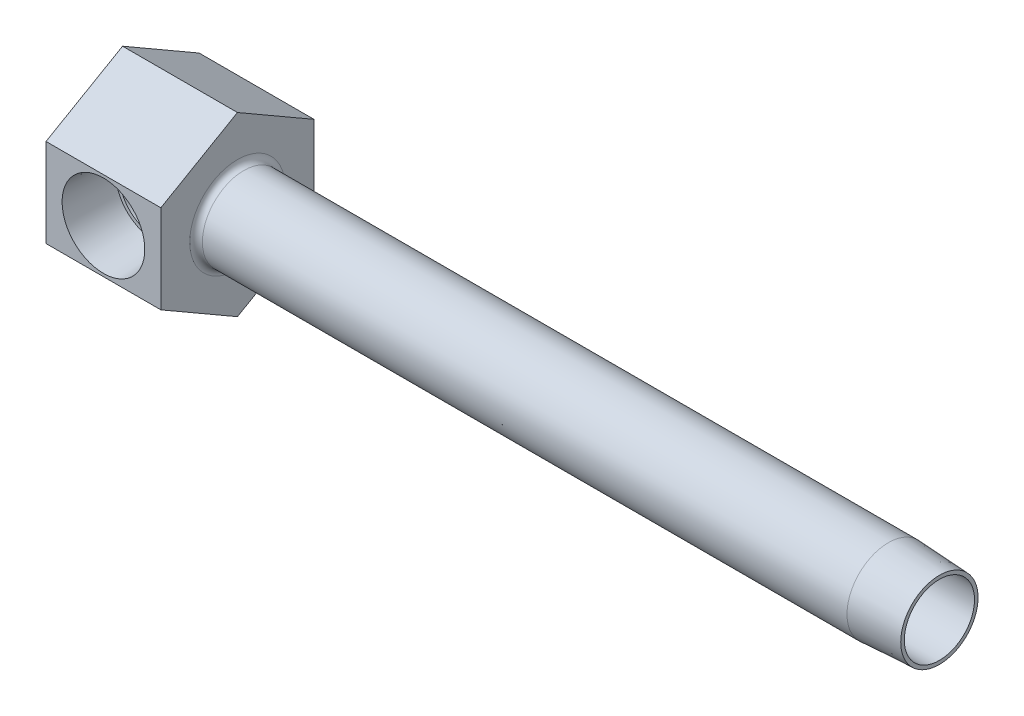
ISO-10303-21;
HEADER;
FILE_DESCRIPTION(('STEP AP214'),'2;1');
FILE_NAME('part.step','',(''),(''),'','','');
FILE_SCHEMA(('AUTOMOTIVE_DESIGN { 1 0 10303 214 1 1 1 1 }'));
ENDSEC;
DATA;
#1=APPLICATION_CONTEXT('core data for automotive mechanical design processes');
#2=APPLICATION_PROTOCOL_DEFINITION('international standard','automotive_design',2000,#1);
#3=PRODUCT_CONTEXT('',#1,'mechanical');
#4=PRODUCT('Part','Part','',(#3));
#5=PRODUCT_RELATED_PRODUCT_CATEGORY('part','',(#4));
#6=PRODUCT_DEFINITION_FORMATION('','',#4);
#7=PRODUCT_DEFINITION_CONTEXT('part definition',#1,'design');
#8=PRODUCT_DEFINITION('design','',#6,#7);
#9=PRODUCT_DEFINITION_SHAPE('','',#8);
#10=(LENGTH_UNIT() NAMED_UNIT(*) SI_UNIT(.MILLI.,.METRE.));
#11=(NAMED_UNIT(*) PLANE_ANGLE_UNIT() SI_UNIT($,.RADIAN.));
#12=(NAMED_UNIT(*) SI_UNIT($,.STERADIAN.) SOLID_ANGLE_UNIT());
#13=UNCERTAINTY_MEASURE_WITH_UNIT(LENGTH_MEASURE(1.E-05),#10,'distance_accuracy_value','');
#14=(GEOMETRIC_REPRESENTATION_CONTEXT(3) GLOBAL_UNCERTAINTY_ASSIGNED_CONTEXT((#13)) GLOBAL_UNIT_ASSIGNED_CONTEXT((#10,
#11,#12)) REPRESENTATION_CONTEXT('',''));
#15=CARTESIAN_POINT('',(0.,0.,0.));
#16=DIRECTION('',(0.,0.,1.));
#17=DIRECTION('',(1.,0.,0.));
#18=AXIS2_PLACEMENT_3D('',#15,#16,#17);
#19=CARTESIAN_POINT('',(7.14375,0.,19.05));
#20=DIRECTION('',(0.,0.,1.));
#21=DIRECTION('',(1.,0.,0.));
#22=AXIS2_PLACEMENT_3D('',#19,#20,#21);
#23=CONICAL_SURFACE('',#22,5.1435,0.0523598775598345);
#24=CARTESIAN_POINT('',(7.14375,0.,19.05));
#25=DIRECTION('',(0.,0.,-1.));
#26=DIRECTION('',(-1.,0.,0.));
#27=AXIS2_PLACEMENT_3D('',#24,#25,#26);
#28=CIRCLE('',#27,5.1435);
#29=CARTESIAN_POINT('',(2.00025,0.,19.05));
#30=VERTEX_POINT('',#29);
#31=EDGE_CURVE('E191',#30,#30,#28,.T.);
#32=ORIENTED_EDGE('',*,*,#31,.F.);
#33=EDGE_LOOP('',(#32));
#34=FACE_BOUND('',#33,.T.);
#35=CARTESIAN_POINT('',(7.14375,0.,12.7000000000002));
#36=DIRECTION('',(0.,0.,-1.));
#37=DIRECTION('',(-1.,0.,0.));
#38=AXIS2_PLACEMENT_3D('',#35,#36,#37);
#39=CIRCLE('',#38,4.81071060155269);
#40=CARTESIAN_POINT('',(10.9073758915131,-2.99634054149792,12.7000000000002));
#41=VERTEX_POINT('',#40);
#42=CARTESIAN_POINT('',(10.9073758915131,2.99634054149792,12.7000000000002));
#43=VERTEX_POINT('',#42);
#44=EDGE_CURVE('E188',#41,#43,#39,.T.);
#45=ORIENTED_EDGE('',*,*,#44,.T.);
#46=CARTESIAN_POINT('',(10.9071937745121,2.99655245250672,12.6998000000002));
#47=CARTESIAN_POINT('',(10.971635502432,2.92155827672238,12.7705639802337));
#48=CARTESIAN_POINT('',(11.0345784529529,2.84341410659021,12.8393139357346));
#49=CARTESIAN_POINT('',(11.1569073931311,2.68056902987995,12.9723675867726));
#50=CARTESIAN_POINT('',(11.2162880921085,2.59585877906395,13.0366646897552));
#51=CARTESIAN_POINT('',(11.3887731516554,2.33059710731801,13.2228141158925));
#52=CARTESIAN_POINT('',(11.4952955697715,2.13996459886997,13.3369144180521));
#53=CARTESIAN_POINT('',(11.6670238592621,1.76978922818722,13.520146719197));
#54=CARTESIAN_POINT('',(11.7362081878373,1.59429861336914,13.5936668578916));
#55=CARTESIAN_POINT('',(11.8243838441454,1.32069459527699,13.6871793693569));
#56=CARTESIAN_POINT('',(11.8511557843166,1.22786736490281,13.7155347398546));
#57=CARTESIAN_POINT('',(11.8990876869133,1.0391950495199,13.7662595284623));
#58=CARTESIAN_POINT('',(11.9202500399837,0.943351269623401,13.7886314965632));
#59=CARTESIAN_POINT('',(11.9566990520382,0.748466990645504,13.8271421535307));
#60=CARTESIAN_POINT('',(11.971935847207,0.649406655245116,13.8432279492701));
#61=CARTESIAN_POINT('',(11.9959472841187,0.449682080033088,13.8685692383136));
#62=CARTESIAN_POINT('',(12.0047249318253,0.349018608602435,13.8778279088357));
#63=CARTESIAN_POINT('',(12.0156291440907,0.146869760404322,13.8893288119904));
#64=CARTESIAN_POINT('',(12.0177517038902,0.0453839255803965,13.8915668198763));
#65=CARTESIAN_POINT('',(12.0152840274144,-0.157407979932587,13.8889645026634));
#66=CARTESIAN_POINT('',(12.0106943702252,-0.258714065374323,13.8841247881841));
#67=CARTESIAN_POINT('',(11.9957865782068,-0.449057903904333,13.8683984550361));
#68=CARTESIAN_POINT('',(11.9861593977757,-0.538211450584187,13.8582411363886));
#69=CARTESIAN_POINT('',(11.961864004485,-0.715062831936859,13.8325939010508));
#70=CARTESIAN_POINT('',(11.9471941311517,-0.802760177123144,13.8171022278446));
#71=CARTESIAN_POINT('',(11.8959888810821,-1.06271154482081,13.762990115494));
#72=CARTESIAN_POINT('',(11.8522396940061,-1.23204639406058,13.7167134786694));
#73=CARTESIAN_POINT('',(11.7458224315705,-1.56656708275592,13.6038703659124));
#74=CARTESIAN_POINT('',(11.6823922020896,-1.73122409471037,13.5364852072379));
#75=CARTESIAN_POINT('',(11.5406571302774,-2.04618319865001,13.3853583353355));
#76=CARTESIAN_POINT('',(11.4623317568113,-2.19646504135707,13.3015940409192));
#77=CARTESIAN_POINT('',(11.3067680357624,-2.45998630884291,13.1343941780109));
#78=CARTESIAN_POINT('',(11.2311482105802,-2.57539375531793,13.0528153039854));
#79=CARTESIAN_POINT('',(11.0735639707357,-2.79452635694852,12.8818550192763));
#80=CARTESIAN_POINT('',(10.9916301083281,-2.89830245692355,12.792510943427));
#81=CARTESIAN_POINT('',(10.9071937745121,-2.99655245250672,12.6998000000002));
#82=B_SPLINE_CURVE_WITH_KNOTS('',3,(#46,#47,#48,#49,#50,#51,#52,#53,#54,#55,#56,#57,#58,#59,#60,
#61,#62,#63,#64,#65,#66,#67,#68,#69,#70,#71,#72,#73,#74,#75,#76,#77,#78,#79,#80,#81),
.UNSPECIFIED.,.F.,.F.,(4,2,2,2,2,2,2,2,2,2,2,2,2,2,2,2,2,4),(0.,0.364634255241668,
0.72979730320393,1.46525067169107,2.06997219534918,2.37170467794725,2.67330836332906,
2.97739780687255,3.28134564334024,3.58547634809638,3.88958081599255,4.15999530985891,
4.43049893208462,4.97084503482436,5.53548493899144,6.10090884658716,6.58103480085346,
7.05896806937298),.UNSPECIFIED.);
#83=EDGE_CURVE('E123',#43,#41,#82,.T.);
#84=ORIENTED_EDGE('',*,*,#83,.T.);
#85=EDGE_LOOP('',(#45,#84));
#86=FACE_BOUND('',#85,.T.);
#87=ADVANCED_FACE('F15',(#34,#86),#23,.F.);
#88=CARTESIAN_POINT('',(11.9544606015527,0.,12.7000000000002));
#89=DIRECTION('',(0.,0.,1.));
#90=DIRECTION('',(1.,0.,0.));
#91=AXIS2_PLACEMENT_3D('',#88,#89,#90);
#92=PLANE('',#91);
#93=ORIENTED_EDGE('',*,*,#44,.F.);
#94=DIRECTION('',(1.,0.,0.));
#95=VECTOR('',#94,1.);
#96=CARTESIAN_POINT('',(66.1375087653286,-2.99634054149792,12.7000000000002));
#97=LINE('',#96,#95);
#98=CARTESIAN_POINT('',(10.3187500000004,-2.99634054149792,12.7000000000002));
#99=VERTEX_POINT('',#98);
#100=EDGE_CURVE('E120',#41,#99,#97,.F.);
#101=ORIENTED_EDGE('',*,*,#100,.T.);
#102=CARTESIAN_POINT('',(7.14375,0.,12.7000000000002));
#103=DIRECTION('',(0.,0.,-1.));
#104=DIRECTION('',(-1.,0.,0.));
#105=AXIS2_PLACEMENT_3D('',#102,#103,#104);
#106=CIRCLE('',#105,4.36562500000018);
#107=CARTESIAN_POINT('',(10.3187500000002,2.99634054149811,12.7000000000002));
#108=VERTEX_POINT('',#107);
#109=EDGE_CURVE('E119',#99,#108,#106,.T.);
#110=ORIENTED_EDGE('',*,*,#109,.T.);
#111=DIRECTION('',(1.,0.,0.));
#112=VECTOR('',#111,1.);
#113=CARTESIAN_POINT('',(66.1375087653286,2.99634054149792,12.7000000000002));
#114=LINE('',#113,#112);
#115=EDGE_CURVE('E126',#108,#43,#114,.T.);
#116=ORIENTED_EDGE('',*,*,#115,.T.);
#117=EDGE_LOOP('',(#93,#101,#110,#116));
#118=FACE_BOUND('',#117,.T.);
#119=ADVANCED_FACE('F165',(#118),#92,.T.);
#120=CARTESIAN_POINT('',(7.14375,0.,35.9059426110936));
#121=DIRECTION('',(0.,0.,-1.));
#122=DIRECTION('',(-1.,0.,0.));
#123=AXIS2_PLACEMENT_3D('',#120,#121,#122);
#124=CYLINDRICAL_SURFACE('',#123,4.36562500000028);
#125=ORIENTED_EDGE('',*,*,#109,.F.);
#126=CARTESIAN_POINT('',(7.14375,0.,9.525));
#127=DIRECTION('',(0.707106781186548,0.,-0.707106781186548));
#128=DIRECTION('',(-0.707106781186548,0.,-0.707106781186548));
#129=AXIS2_PLACEMENT_3D('',#126,#127,#128);
#130=ELLIPSE('',#129,6.17392608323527,4.36562500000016);
#131=CARTESIAN_POINT('',(7.14375,-4.3656250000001,9.525));
#132=VERTEX_POINT('',#131);
#133=EDGE_CURVE('E105',#99,#132,#130,.T.);
#134=ORIENTED_EDGE('',*,*,#133,.T.);
#135=CARTESIAN_POINT('',(7.14375,0.,9.525));
#136=DIRECTION('',(-0.707106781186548,0.,-0.707106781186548));
#137=DIRECTION('',(0.707106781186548,0.,-0.707106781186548));
#138=AXIS2_PLACEMENT_3D('',#135,#136,#137);
#139=ELLIPSE('',#138,6.17392608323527,4.36562500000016);
#140=CARTESIAN_POINT('',(8.98888023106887,-3.95653586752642,7.67986976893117));
#141=VERTEX_POINT('',#140);
#142=EDGE_CURVE('E100',#132,#141,#139,.F.);
#143=ORIENTED_EDGE('',*,*,#142,.T.);
#144=CARTESIAN_POINT('',(7.14375,0.,7.67986976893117));
#145=DIRECTION('',(0.,0.,-1.));
#146=DIRECTION('',(-1.,0.,0.));
#147=AXIS2_PLACEMENT_3D('',#144,#145,#146);
#148=CIRCLE('',#147,4.36562500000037);
#149=CARTESIAN_POINT('',(8.98888023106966,3.95653586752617,7.67986976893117));
#150=VERTEX_POINT('',#149);
#151=EDGE_CURVE('E113',#141,#150,#148,.T.);
#152=ORIENTED_EDGE('',*,*,#151,.T.);
#153=CARTESIAN_POINT('',(7.14375,4.3656250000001,9.525));
#154=VERTEX_POINT('',#153);
#155=EDGE_CURVE('E30',#150,#154,#139,.F.);
#156=ORIENTED_EDGE('',*,*,#155,.T.);
#157=EDGE_CURVE('E122',#154,#108,#130,.T.);
#158=ORIENTED_EDGE('',*,*,#157,.T.);
#159=EDGE_LOOP('',(#125,#134,#143,#152,#156,#158));
#160=FACE_BOUND('',#159,.T.);
#161=ADVANCED_FACE('F116',(#160),#124,.F.);
#162=CARTESIAN_POINT('',(7.14375,0.,7.67986976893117));
#163=DIRECTION('',(0.,0.,1.));
#164=DIRECTION('',(1.,0.,0.));
#165=AXIS2_PLACEMENT_3D('',#162,#163,#164);
#166=CONICAL_SURFACE('',#165,4.36562500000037,1.0471975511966);
#167=ORIENTED_EDGE('',*,*,#151,.F.);
#168=CARTESIAN_POINT('',(8.9894997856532,-3.95662913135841,7.68006976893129));
#169=CARTESIAN_POINT('',(8.91497560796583,-3.94541760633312,7.6560189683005));
#170=CARTESIAN_POINT('',(8.84020256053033,-3.93428272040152,7.6327193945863));
#171=CARTESIAN_POINT('',(8.69001846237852,-3.91242782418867,7.58793860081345));
#172=CARTESIAN_POINT('',(8.61460714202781,-3.90170800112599,7.56645819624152));
#173=CARTESIAN_POINT('',(8.38848524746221,-3.87074056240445,7.50556917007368));
#174=CARTESIAN_POINT('',(8.2367287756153,-3.8515020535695,7.46932807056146));
#175=CARTESIAN_POINT('',(8.00667896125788,-3.82676825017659,7.42384959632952));
#176=CARTESIAN_POINT('',(7.92948623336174,-3.81920348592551,7.41015805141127));
#177=CARTESIAN_POINT('',(7.77441965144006,-3.80585437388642,7.38622945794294));
#178=CARTESIAN_POINT('',(7.69654594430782,-3.80006965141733,7.37599168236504));
#179=CARTESIAN_POINT('',(7.53967894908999,-3.79060206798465,7.35933225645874));
#180=CARTESIAN_POINT('',(7.46068163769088,-3.78693482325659,7.35293894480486));
#181=CARTESIAN_POINT('',(7.30231301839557,-3.7819879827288,7.34434534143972));
#182=CARTESIAN_POINT('',(7.2229414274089,-3.78071064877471,7.34214902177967));
#183=CARTESIAN_POINT('',(7.14355,-3.78074215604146,7.34218750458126));
#184=B_SPLINE_CURVE_WITH_KNOTS('',3,(#168,#169,#170,#171,#172,#173,#174,#175,#176,#177,#178,
#179,#180,#181,#182,#183),.UNSPECIFIED.,.F.,.F.,(4,2,2,2,2,2,2,4),(0.,0.237303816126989,
0.474713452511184,0.945835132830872,1.18204117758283,1.41819746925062,1.65607385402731,
1.89417525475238),.UNSPECIFIED.);
#185=CARTESIAN_POINT('',(7.14375,-3.78074215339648,7.34218750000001));
#186=VERTEX_POINT('',#185);
#187=EDGE_CURVE('E109',#141,#186,#184,.T.);
#188=ORIENTED_EDGE('',*,*,#187,.T.);
#189=DIRECTION('',(0.,0.866025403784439,-0.5));
#190=VECTOR('',#189,1.);
#191=CARTESIAN_POINT('',(7.14375,0.,5.159375));
#192=LINE('',#191,#190);
#193=CARTESIAN_POINT('',(7.14375,0.,5.159375));
#194=VERTEX_POINT('',#193);
#195=EDGE_CURVE('E262',#186,#194,#192,.T.);
#196=ORIENTED_EDGE('',*,*,#195,.T.);
#197=DIRECTION('',(0.,0.866025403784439,0.5));
#198=VECTOR('',#197,1.);
#199=CARTESIAN_POINT('',(7.14375,0.,5.159375));
#200=LINE('',#199,#198);
#201=CARTESIAN_POINT('',(7.14375,3.78074215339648,7.34218750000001));
#202=VERTEX_POINT('',#201);
#203=EDGE_CURVE('E248',#194,#202,#200,.T.);
#204=ORIENTED_EDGE('',*,*,#203,.T.);
#205=CARTESIAN_POINT('',(7.14355,3.78074215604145,7.34218750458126));
#206=CARTESIAN_POINT('',(7.20515303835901,3.78073202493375,7.34217451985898));
#207=CARTESIAN_POINT('',(7.26674694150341,3.78149280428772,7.34348695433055));
#208=CARTESIAN_POINT('',(7.38976236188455,3.78448017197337,7.34867189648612));
#209=CARTESIAN_POINT('',(7.45118394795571,3.78670605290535,7.3525431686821));
#210=CARTESIAN_POINT('',(7.63466542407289,3.79545033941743,7.36782927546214));
#211=CARTESIAN_POINT('',(7.75632841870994,3.80403629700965,7.38291749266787));
#212=CARTESIAN_POINT('',(8.11659337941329,3.83592256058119,7.44024735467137));
#213=CARTESIAN_POINT('',(8.35266311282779,3.8653919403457,7.49460284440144));
#214=CARTESIAN_POINT('',(8.65303625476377,3.90716169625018,7.57737916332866));
#215=CARTESIAN_POINT('',(8.72054620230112,3.91683509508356,7.59689306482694));
#216=CARTESIAN_POINT('',(8.855265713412,3.93652410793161,7.63741882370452));
#217=CARTESIAN_POINT('',(8.92247399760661,3.94654056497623,7.65843453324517));
#218=CARTESIAN_POINT('',(8.9894997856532,3.9566291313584,7.68006976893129));
#219=B_SPLINE_CURVE_WITH_KNOTS('',3,(#205,#206,#207,#208,#209,#210,#211,#212,#213,#214,#215,
#216,#217,#218),.UNSPECIFIED.,.F.,.F.,(4,2,2,2,2,2,4),(0.,0.184774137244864,0.369459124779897,
0.73767480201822,1.46761028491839,1.68043381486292,1.89382432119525),.UNSPECIFIED.);
#220=EDGE_CURVE('E242',#202,#150,#219,.T.);
#221=ORIENTED_EDGE('',*,*,#220,.T.);
#222=EDGE_LOOP('',(#167,#188,#196,#204,#221));
#223=FACE_BOUND('',#222,.T.);
#224=ADVANCED_FACE('F250',(#223),#166,.F.);
#225=CARTESIAN_POINT('',(14.2875,5.4992613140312,19.05));
#226=DIRECTION('',(0.,0.,-1.));
#227=DIRECTION('',(-1.,0.,0.));
#228=AXIS2_PLACEMENT_3D('',#225,#226,#227);
#229=PLANE('',#228);
#230=DIRECTION('',(0.,-1.,0.));
#231=VECTOR('',#230,1.);
#232=CARTESIAN_POINT('',(0.,5.4992613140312,19.05));
#233=LINE('',#232,#231);
#234=CARTESIAN_POINT('',(0.,5.4992613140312,19.05));
#235=VERTEX_POINT('',#234);
#236=CARTESIAN_POINT('',(0.,-5.49926131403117,19.05));
#237=VERTEX_POINT('',#236);
#238=EDGE_CURVE('E204',#235,#237,#233,.T.);
#239=ORIENTED_EDGE('',*,*,#238,.T.);
#240=DIRECTION('',(-1.,0.,0.));
#241=VECTOR('',#240,1.);
#242=CARTESIAN_POINT('',(14.2875,-5.49926131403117,19.05));
#243=LINE('',#242,#241);
#244=CARTESIAN_POINT('',(14.2875,-5.49926131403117,19.05));
#245=VERTEX_POINT('',#244);
#246=EDGE_CURVE('E227',#245,#237,#243,.T.);
#247=ORIENTED_EDGE('',*,*,#246,.F.);
#248=DIRECTION('',(0.,-1.,0.));
#249=VECTOR('',#248,1.);
#250=CARTESIAN_POINT('',(14.2875,5.4992613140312,19.05));
#251=LINE('',#250,#249);
#252=CARTESIAN_POINT('',(14.2875,5.4992613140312,19.05));
#253=VERTEX_POINT('',#252);
#254=EDGE_CURVE('E220',#253,#245,#251,.T.);
#255=ORIENTED_EDGE('',*,*,#254,.F.);
#256=DIRECTION('',(-1.,0.,0.));
#257=VECTOR('',#256,1.);
#258=CARTESIAN_POINT('',(14.2875,5.4992613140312,19.05));
#259=LINE('',#258,#257);
#260=EDGE_CURVE('E230',#253,#235,#259,.T.);
#261=ORIENTED_EDGE('',*,*,#260,.T.);
#262=EDGE_LOOP('',(#239,#247,#255,#261));
#263=FACE_BOUND('',#262,.T.);
#264=ORIENTED_EDGE('',*,*,#31,.T.);
#265=EDGE_LOOP('',(#264));
#266=FACE_BOUND('',#265,.T.);
#267=ADVANCED_FACE('F253',(#263,#266),#229,.F.);
#268=CARTESIAN_POINT('',(14.2875,-5.49926131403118,0.));
#269=DIRECTION('',(1.,0.,0.));
#270=DIRECTION('',(0.,1.,0.));
#271=AXIS2_PLACEMENT_3D('',#268,#269,#270);
#272=PLANE('',#271);
#273=CARTESIAN_POINT('',(14.2875,0.,9.525));
#274=DIRECTION('',(1.,0.,0.));
#275=DIRECTION('',(0.,1.,0.));
#276=AXIS2_PLACEMENT_3D('',#273,#274,#275);
#277=CIRCLE('',#276,5.9309);
#278=CARTESIAN_POINT('',(14.2875,5.9309,9.525));
#279=VERTEX_POINT('',#278);
#280=EDGE_CURVE('E261',#279,#279,#277,.F.);
#281=ORIENTED_EDGE('',*,*,#280,.T.);
#282=EDGE_LOOP('',(#281));
#283=FACE_BOUND('',#282,.T.);
#284=DIRECTION('',(0.,0.5,-0.866025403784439));
#285=VECTOR('',#284,1.);
#286=CARTESIAN_POINT('',(14.2875,-10.9985226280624,9.525));
#287=LINE('',#286,#285);
#288=CARTESIAN_POINT('',(14.2875,-10.9985226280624,9.525));
#289=VERTEX_POINT('',#288);
#290=CARTESIAN_POINT('',(14.2875,-5.49926131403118,0.));
#291=VERTEX_POINT('',#290);
#292=EDGE_CURVE('E210',#289,#291,#287,.T.);
#293=ORIENTED_EDGE('',*,*,#292,.T.);
#294=DIRECTION('',(0.,1.,0.));
#295=VECTOR('',#294,1.);
#296=CARTESIAN_POINT('',(14.2875,-5.49926131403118,0.));
#297=LINE('',#296,#295);
#298=CARTESIAN_POINT('',(14.2875,5.49926131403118,0.));
#299=VERTEX_POINT('',#298);
#300=EDGE_CURVE('E214',#291,#299,#297,.T.);
#301=ORIENTED_EDGE('',*,*,#300,.T.);
#302=DIRECTION('',(0.,0.5,0.866025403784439));
#303=VECTOR('',#302,1.);
#304=CARTESIAN_POINT('',(14.2875,5.49926131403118,0.));
#305=LINE('',#304,#303);
#306=CARTESIAN_POINT('',(14.2875,10.9985226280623,9.525));
#307=VERTEX_POINT('',#306);
#308=EDGE_CURVE('E216',#299,#307,#305,.T.);
#309=ORIENTED_EDGE('',*,*,#308,.T.);
#310=DIRECTION('',(0.,-0.5,0.86602540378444));
#311=VECTOR('',#310,1.);
#312=CARTESIAN_POINT('',(14.2875,10.9985226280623,9.525));
#313=LINE('',#312,#311);
#314=EDGE_CURVE('E218',#307,#253,#313,.T.);
#315=ORIENTED_EDGE('',*,*,#314,.T.);
#316=ORIENTED_EDGE('',*,*,#254,.T.);
#317=DIRECTION('',(0.,-0.5,-0.866025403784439));
#318=VECTOR('',#317,1.);
#319=CARTESIAN_POINT('',(14.2875,-5.49926131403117,19.05));
#320=LINE('',#319,#318);
#321=EDGE_CURVE('E38',#245,#289,#320,.T.);
#322=ORIENTED_EDGE('',*,*,#321,.T.);
#323=EDGE_LOOP('',(#293,#301,#309,#315,#316,#322));
#324=FACE_BOUND('',#323,.T.);
#325=ADVANCED_FACE('F270',(#283,#324),#272,.T.);
#326=CARTESIAN_POINT('',(14.2875,-10.9985226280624,9.525));
#327=DIRECTION('',(0.,0.866025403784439,0.5));
#328=DIRECTION('',(0.,-0.5,0.866025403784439));
#329=AXIS2_PLACEMENT_3D('',#326,#327,#328);
#330=PLANE('',#329);
#331=DIRECTION('',(0.,0.5,-0.866025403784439));
#332=VECTOR('',#331,1.);
#333=CARTESIAN_POINT('',(0.,-10.9985226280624,9.525));
#334=LINE('',#333,#332);
#335=CARTESIAN_POINT('',(0.,-10.9985226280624,9.525));
#336=VERTEX_POINT('',#335);
#337=CARTESIAN_POINT('',(0.,-5.49926131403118,0.));
#338=VERTEX_POINT('',#337);
#339=EDGE_CURVE('E194',#336,#338,#334,.T.);
#340=ORIENTED_EDGE('',*,*,#339,.T.);
#341=DIRECTION('',(-1.,0.,0.));
#342=VECTOR('',#341,1.);
#343=CARTESIAN_POINT('',(14.2875,-5.49926131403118,0.));
#344=LINE('',#343,#342);
#345=EDGE_CURVE('E239',#291,#338,#344,.T.);
#346=ORIENTED_EDGE('',*,*,#345,.F.);
#347=ORIENTED_EDGE('',*,*,#292,.F.);
#348=DIRECTION('',(-1.,0.,0.));
#349=VECTOR('',#348,1.);
#350=CARTESIAN_POINT('',(14.2875,-10.9985226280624,9.525));
#351=LINE('',#350,#349);
#352=EDGE_CURVE('E223',#289,#336,#351,.T.);
#353=ORIENTED_EDGE('',*,*,#352,.T.);
#354=EDGE_LOOP('',(#340,#346,#347,#353));
#355=FACE_BOUND('',#354,.T.);
#356=ADVANCED_FACE('F272',(#355),#330,.F.);
#357=CARTESIAN_POINT('',(14.2875,-5.49926131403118,0.));
#358=DIRECTION('',(0.,0.,1.));
#359=DIRECTION('',(0.,-1.,0.));
#360=AXIS2_PLACEMENT_3D('',#357,#358,#359);
#361=PLANE('',#360);
#362=DIRECTION('',(0.,1.,0.));
#363=VECTOR('',#362,1.);
#364=CARTESIAN_POINT('',(0.,-5.49926131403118,0.));
#365=LINE('',#364,#363);
#366=CARTESIAN_POINT('',(0.,5.49926131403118,0.));
#367=VERTEX_POINT('',#366);
#368=EDGE_CURVE('E195',#338,#367,#365,.T.);
#369=ORIENTED_EDGE('',*,*,#368,.T.);
#370=DIRECTION('',(-1.,0.,0.));
#371=VECTOR('',#370,1.);
#372=CARTESIAN_POINT('',(14.2875,5.49926131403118,0.));
#373=LINE('',#372,#371);
#374=EDGE_CURVE('E236',#299,#367,#373,.T.);
#375=ORIENTED_EDGE('',*,*,#374,.F.);
#376=ORIENTED_EDGE('',*,*,#300,.F.);
#377=ORIENTED_EDGE('',*,*,#345,.T.);
#378=EDGE_LOOP('',(#369,#375,#376,#377));
#379=FACE_BOUND('',#378,.T.);
#380=ADVANCED_FACE('F279',(#379),#361,.F.);
#381=CARTESIAN_POINT('',(14.2875,5.49926131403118,0.));
#382=DIRECTION('',(0.,-0.866025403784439,0.5));
#383=DIRECTION('',(0.,-0.5,-0.866025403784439));
#384=AXIS2_PLACEMENT_3D('',#381,#382,#383);
#385=PLANE('',#384);
#386=DIRECTION('',(0.,0.5,0.866025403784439));
#387=VECTOR('',#386,1.);
#388=CARTESIAN_POINT('',(0.,5.49926131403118,0.));
#389=LINE('',#388,#387);
#390=CARTESIAN_POINT('',(0.,10.9985226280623,9.525));
#391=VERTEX_POINT('',#390);
#392=EDGE_CURVE('E198',#367,#391,#389,.T.);
#393=ORIENTED_EDGE('',*,*,#392,.T.);
#394=DIRECTION('',(-1.,0.,0.));
#395=VECTOR('',#394,1.);
#396=CARTESIAN_POINT('',(14.2875,10.9985226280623,9.525));
#397=LINE('',#396,#395);
#398=EDGE_CURVE('E233',#307,#391,#397,.T.);
#399=ORIENTED_EDGE('',*,*,#398,.F.);
#400=ORIENTED_EDGE('',*,*,#308,.F.);
#401=ORIENTED_EDGE('',*,*,#374,.T.);
#402=EDGE_LOOP('',(#393,#399,#400,#401));
#403=FACE_BOUND('',#402,.T.);
#404=ADVANCED_FACE('F284',(#403),#385,.F.);
#405=CARTESIAN_POINT('',(14.2875,10.9985226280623,9.525));
#406=DIRECTION('',(0.,-0.86602540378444,-0.5));
#407=DIRECTION('',(0.,0.5,-0.86602540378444));
#408=AXIS2_PLACEMENT_3D('',#405,#406,#407);
#409=PLANE('',#408);
#410=DIRECTION('',(0.,-0.5,0.86602540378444));
#411=VECTOR('',#410,1.);
#412=CARTESIAN_POINT('',(0.,10.9985226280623,9.525));
#413=LINE('',#412,#411);
#414=EDGE_CURVE('E201',#391,#235,#413,.T.);
#415=ORIENTED_EDGE('',*,*,#414,.T.);
#416=ORIENTED_EDGE('',*,*,#260,.F.);
#417=ORIENTED_EDGE('',*,*,#314,.F.);
#418=ORIENTED_EDGE('',*,*,#398,.T.);
#419=EDGE_LOOP('',(#415,#416,#417,#418));
#420=FACE_BOUND('',#419,.T.);
#421=ADVANCED_FACE('F290',(#420),#409,.F.);
#422=CARTESIAN_POINT('',(14.2875,-5.49926131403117,19.05));
#423=DIRECTION('',(0.,0.866025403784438,-0.5));
#424=DIRECTION('',(0.,0.5,0.866025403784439));
#425=AXIS2_PLACEMENT_3D('',#422,#423,#424);
#426=PLANE('',#425);
#427=DIRECTION('',(0.,-0.5,-0.866025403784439));
#428=VECTOR('',#427,1.);
#429=CARTESIAN_POINT('',(0.,-5.49926131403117,19.05));
#430=LINE('',#429,#428);
#431=EDGE_CURVE('E207',#237,#336,#430,.T.);
#432=ORIENTED_EDGE('',*,*,#431,.T.);
#433=ORIENTED_EDGE('',*,*,#352,.F.);
#434=ORIENTED_EDGE('',*,*,#321,.F.);
#435=ORIENTED_EDGE('',*,*,#246,.T.);
#436=EDGE_LOOP('',(#432,#433,#434,#435));
#437=FACE_BOUND('',#436,.T.);
#438=ADVANCED_FACE('F297',(#437),#426,.F.);
#439=CARTESIAN_POINT('',(0.,-5.49926131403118,0.));
#440=DIRECTION('',(1.,0.,0.));
#441=DIRECTION('',(0.,1.,0.));
#442=AXIS2_PLACEMENT_3D('',#439,#440,#441);
#443=PLANE('',#442);
#444=ORIENTED_EDGE('',*,*,#339,.F.);
#445=ORIENTED_EDGE('',*,*,#431,.F.);
#446=ORIENTED_EDGE('',*,*,#238,.F.);
#447=ORIENTED_EDGE('',*,*,#414,.F.);
#448=ORIENTED_EDGE('',*,*,#392,.F.);
#449=ORIENTED_EDGE('',*,*,#368,.F.);
#450=EDGE_LOOP('',(#444,#445,#446,#447,#448,#449));
#451=FACE_BOUND('',#450,.T.);
#452=ADVANCED_FACE('F179',(#451),#443,.F.);
#453=CARTESIAN_POINT('',(68.0114010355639,0.,9.525));
#454=DIRECTION('',(-1.,0.,0.));
#455=DIRECTION('',(0.,0.,1.));
#456=AXIS2_PLACEMENT_3D('',#453,#454,#455);
#457=CYLINDRICAL_SURFACE('',#456,5.1435);
#458=CARTESIAN_POINT('',(95.25,0.,9.525));
#459=DIRECTION('',(-1.,0.,0.));
#460=DIRECTION('',(0.,0.,1.));
#461=AXIS2_PLACEMENT_3D('',#458,#459,#460);
#462=CIRCLE('',#461,5.1435);
#463=CARTESIAN_POINT('',(95.25,0.,14.6685));
#464=VERTEX_POINT('',#463);
#465=EDGE_CURVE('E10',#464,#464,#462,.F.);
#466=ORIENTED_EDGE('',*,*,#465,.F.);
#467=EDGE_LOOP('',(#466));
#468=FACE_BOUND('',#467,.T.);
#469=CARTESIAN_POINT('',(15.0749,0.,9.525));
#470=DIRECTION('',(1.,0.,0.));
#471=DIRECTION('',(0.,1.,0.));
#472=AXIS2_PLACEMENT_3D('',#469,#470,#471);
#473=CIRCLE('',#472,5.1435);
#474=CARTESIAN_POINT('',(15.0749,5.1435,9.525));
#475=VERTEX_POINT('',#474);
#476=EDGE_CURVE('E23',#475,#475,#473,.T.);
#477=ORIENTED_EDGE('',*,*,#476,.T.);
#478=EDGE_LOOP('',(#477));
#479=FACE_BOUND('',#478,.T.);
#480=ADVANCED_FACE('F17',(#468,#479),#457,.T.);
#481=CARTESIAN_POINT('',(7.14375,0.,9.525));
#482=DIRECTION('',(1.,0.,0.));
#483=DIRECTION('',(0.,0.,-1.));
#484=AXIS2_PLACEMENT_3D('',#481,#482,#483);
#485=PLANE('',#484);
#486=CARTESIAN_POINT('',(7.14375,0.,9.525));
#487=DIRECTION('',(1.,0.,0.));
#488=DIRECTION('',(0.,0.,-1.));
#489=AXIS2_PLACEMENT_3D('',#486,#487,#488);
#490=CIRCLE('',#489,4.365625);
#491=EDGE_CURVE('E130',#194,#202,#490,.T.);
#492=ORIENTED_EDGE('',*,*,#491,.T.);
#493=ORIENTED_EDGE('',*,*,#203,.F.);
#494=EDGE_LOOP('',(#492,#493));
#495=FACE_BOUND('',#494,.T.);
#496=ADVANCED_FACE('F160',(#495),#485,.T.);
#497=EDGE_CURVE('E128',#186,#194,#490,.T.);
#498=ORIENTED_EDGE('',*,*,#497,.T.);
#499=ORIENTED_EDGE('',*,*,#195,.F.);
#500=EDGE_LOOP('',(#498,#499));
#501=FACE_BOUND('',#500,.T.);
#502=ADVANCED_FACE('F150',(#501),#485,.T.);
#503=CARTESIAN_POINT('',(66.1375087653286,0.,9.525));
#504=DIRECTION('',(1.,0.,0.));
#505=DIRECTION('',(0.,0.,-1.));
#506=AXIS2_PLACEMENT_3D('',#503,#504,#505);
#507=CYLINDRICAL_SURFACE('',#506,4.365625);
#508=ORIENTED_EDGE('',*,*,#142,.F.);
#509=ORIENTED_EDGE('',*,*,#133,.F.);
#510=ORIENTED_EDGE('',*,*,#100,.F.);
#511=ORIENTED_EDGE('',*,*,#83,.F.);
#512=ORIENTED_EDGE('',*,*,#115,.F.);
#513=ORIENTED_EDGE('',*,*,#157,.F.);
#514=ORIENTED_EDGE('',*,*,#155,.F.);
#515=ORIENTED_EDGE('',*,*,#220,.F.);
#516=ORIENTED_EDGE('',*,*,#491,.F.);
#517=ORIENTED_EDGE('',*,*,#497,.F.);
#518=ORIENTED_EDGE('',*,*,#187,.F.);
#519=EDGE_LOOP('',(#508,#509,#510,#511,#512,#513,#514,#515,#516,#517,#518));
#520=FACE_BOUND('',#519,.T.);
#521=CARTESIAN_POINT('',(101.6,0.,9.525));
#522=DIRECTION('',(-1.,0.,0.));
#523=DIRECTION('',(0.,0.,1.));
#524=AXIS2_PLACEMENT_3D('',#521,#522,#523);
#525=CIRCLE('',#524,4.365625);
#526=CARTESIAN_POINT('',(101.6,0.,13.890625));
#527=VERTEX_POINT('',#526);
#528=EDGE_CURVE('E134',#527,#527,#525,.T.);
#529=ORIENTED_EDGE('',*,*,#528,.F.);
#530=EDGE_LOOP('',(#529));
#531=FACE_BOUND('',#530,.T.);
#532=ADVANCED_FACE('F102',(#520,#531),#507,.F.);
#533=CARTESIAN_POINT('',(15.0749,0.,9.525));
#534=DIRECTION('',(1.,0.,0.));
#535=DIRECTION('',(0.,1.,0.));
#536=AXIS2_PLACEMENT_3D('',#533,#534,#535);
#537=TOROIDAL_SURFACE('',#536,5.9309,0.7874);
#538=ORIENTED_EDGE('',*,*,#476,.F.);
#539=EDGE_LOOP('',(#538));
#540=FACE_BOUND('',#539,.T.);
#541=ORIENTED_EDGE('',*,*,#280,.F.);
#542=EDGE_LOOP('',(#541));
#543=FACE_BOUND('',#542,.T.);
#544=ADVANCED_FACE('F146',(#540,#543),#537,.F.);
#545=CARTESIAN_POINT('',(101.6,0.,5.159375));
#546=DIRECTION('',(-1.,0.,0.));
#547=DIRECTION('',(0.,0.,1.));
#548=AXIS2_PLACEMENT_3D('',#545,#546,#547);
#549=PLANE('',#548);
#550=CARTESIAN_POINT('',(101.6,0.,9.525));
#551=DIRECTION('',(-1.,0.,0.));
#552=DIRECTION('',(0.,0.,1.));
#553=AXIS2_PLACEMENT_3D('',#550,#551,#552);
#554=CIRCLE('',#553,4.81071060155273);
#555=CARTESIAN_POINT('',(101.6,0.,14.3357106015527));
#556=VERTEX_POINT('',#555);
#557=EDGE_CURVE('E137',#556,#556,#554,.T.);
#558=ORIENTED_EDGE('',*,*,#557,.F.);
#559=EDGE_LOOP('',(#558));
#560=FACE_BOUND('',#559,.T.);
#561=ORIENTED_EDGE('',*,*,#528,.T.);
#562=EDGE_LOOP('',(#561));
#563=FACE_BOUND('',#562,.T.);
#564=ADVANCED_FACE('F143',(#560,#563),#549,.F.);
#565=CARTESIAN_POINT('',(101.6,0.,9.525));
#566=DIRECTION('',(-1.,0.,0.));
#567=DIRECTION('',(0.,0.,1.));
#568=AXIS2_PLACEMENT_3D('',#565,#566,#567);
#569=CONICAL_SURFACE('',#568,4.81071060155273,0.052359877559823);
#570=ORIENTED_EDGE('',*,*,#465,.T.);
#571=EDGE_LOOP('',(#570));
#572=FACE_BOUND('',#571,.T.);
#573=ORIENTED_EDGE('',*,*,#557,.T.);
#574=EDGE_LOOP('',(#573));
#575=FACE_BOUND('',#574,.T.);
#576=ADVANCED_FACE('F141',(#572,#575),#569,.T.);
#577=CLOSED_SHELL('',(#87,#119,#161,#224,#267,#325,#356,#380,#404,#421,#438,#452,#480,#496,#502,
#532,#544,#564,#576));
#578=MANIFOLD_SOLID_BREP('B1',#577);
#579=ADVANCED_BREP_SHAPE_REPRESENTATION('',(#18,#578),#14);
#580=SHAPE_DEFINITION_REPRESENTATION(#9,#579);
ENDSEC;
END-ISO-10303-21;
